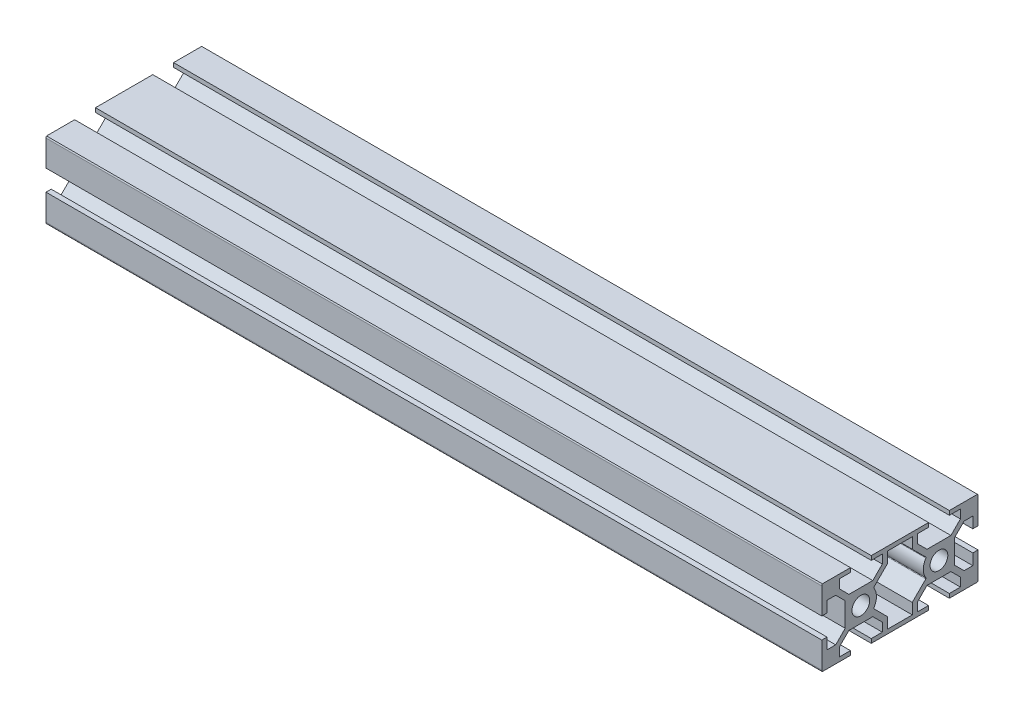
from build123d import *

# Parameters (mm, degrees)
SKETCH1_R           = 3.4
BOSS_EXTRUDE1_DEPTH = 298


with BuildPart() as part:
    # Sketch1 → Boss-Extrude1 (new body)
    with BuildSketch(Plane(origin=(0, 0, 0), x_dir=(0, 0, -1), z_dir=(1, 0, 0))):
        with BuildLine():
            Line((-30, 14), (-30, 4))
            Line((-30, 4), (-28, 4))
            Line((-28, 4), (-28, 8.25))
            Line((-28, 8.25), (-24.664213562, 8.25))
            Line((-24.664213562, 8.25), (-21, 4.585786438))
            Line((-21, 4.585786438), (-21, -4.585786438))
            Line((-21, -4.585786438), (-24.664213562, -8.25))
            Line((-24.664213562, -8.25), (-28, -8.25))
            Line((-28, -8.25), (-28, -4))
            Line((-28, -4), (-30, -4))
            Line((-30, -4), (-30, -14))
            ThreePointArc((-30, -14), (-29.948683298, -14.316227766), (-29.8, -14.6))
            Line((-29.8, -14.6), (-19, -14.6))
            Line((-19, -14.6), (-19, -13))
            Line((-19, -13), (-23.25, -13))
            Line((-23.25, -13), (-23.25, -9.664213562))
            Line((-23.25, -9.664213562), (-19.585786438, -6))
            Line((-19.585786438, -6), (-10.414213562, -6))
            Line((-10.414213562, -6), (-6.75, -9.664213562))
            Line((-6.75, -9.664213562), (-6.75, -13))
            Line((-6.75, -13), (-11, -13))
            Line((-11, -13), (-11, -14.6))
            Line((-11, -14.6), (11, -14.6))
            Line((11, -14.6), (11, -13))
            Line((11, -13), (6.75, -13))
            Line((6.75, -13), (6.75, -9.664213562))
            Line((6.75, -9.664213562), (10.414213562, -6))
            Line((10.414213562, -6), (19.585786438, -6))
            Line((19.585786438, -6), (23.25, -9.664213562))
            Line((23.25, -9.664213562), (23.25, -13))
            Line((23.25, -13), (19, -13))
            Line((19, -13), (19, -14.6))
            Line((19, -14.6), (29.8, -14.6))
            ThreePointArc((29.8, -14.6), (29.948683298, -14.316227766), (30, -14))
            Line((30, -14), (30, -4))
            Line((30, -4), (28, -4))
            Line((28, -4), (28, -8.25))
            Line((28, -8.25), (24.664213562, -8.25))
            Line((24.664213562, -8.25), (21, -4.585786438))
            Line((21, -4.585786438), (21, 4.585786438))
            Line((21, 4.585786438), (24.664213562, 8.25))
            Line((24.664213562, 8.25), (28, 8.25))
            Line((28, 8.25), (28, 4))
            Line((28, 4), (30, 4))
            Line((30, 4), (30, 14))
            ThreePointArc((30, 14), (29.948683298, 14.316227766), (29.8, 14.6))
            Line((29.8, 14.6), (19, 14.6))
            Line((19, 14.6), (19, 13))
            Line((19, 13), (23.25, 13))
            Line((23.25, 13), (23.25, 9.664213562))
            Line((23.25, 9.664213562), (19.585786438, 6))
            Line((19.585786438, 6), (10.414213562, 6))
            Line((10.414213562, 6), (6.75, 9.664213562))
            Line((6.75, 9.664213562), (6.75, 13))
            Line((6.75, 13), (11, 13))
            Line((11, 13), (11, 14.6))
            Line((11, 14.6), (-11, 14.6))
            Line((-11, 14.6), (-11, 13))
            Line((-11, 13), (-6.75, 13))
            Line((-6.75, 13), (-6.75, 9.664213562))
            Line((-6.75, 9.664213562), (-10.414213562, 6))
            Line((-10.414213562, 6), (-19.585786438, 6))
            Line((-19.585786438, 6), (-23.25, 9.664213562))
            Line((-23.25, 9.664213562), (-23.25, 13))
            Line((-23.25, 13), (-19, 13))
            Line((-19, 13), (-19, 14.6))
            Line((-19, 14.6), (-29.8, 14.6))
            ThreePointArc((-29.8, 14.6), (-29.948683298, 14.316227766), (-30, 14))
        make_face()
        with Locations((-15, 0)):
            Circle(SKETCH1_R, mode=Mode.SUBTRACT)
        with Locations((15, 0)):
            Circle(SKETCH1_R, mode=Mode.SUBTRACT)
        with BuildLine():
            Line((-4.75, 8.835786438), (-9.933994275, 3.651792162))
            ThreePointArc((-9.933994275, 3.651792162), (-10.020243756, 3.470780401), (-9.973202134, 3.275866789))
            ThreePointArc((-9.973202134, 3.275866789), (-9, 0), (-9.973202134, -3.275866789))
            ThreePointArc((-9.973202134, -3.275866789), (-10.020243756, -3.470780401), (-9.933994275, -3.651792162))
            Line((-9.933994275, -3.651792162), (-4.75, -8.835786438))
            Line((-4.75, -8.835786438), (-4.75, -13))
            Line((-4.75, -13), (4.75, -13))
            Line((4.75, -13), (4.75, -8.835786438))
            Line((4.75, -8.835786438), (9.933994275, -3.651792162))
            ThreePointArc((9.933994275, -3.651792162), (10.020243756, -3.470780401), (9.973202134, -3.275866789))
            ThreePointArc((9.973202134, -3.275866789), (9, 0), (9.973202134, 3.275866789))
            ThreePointArc((9.973202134, 3.275866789), (10.020243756, 3.470780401), (9.933994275, 3.651792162))
            Line((9.933994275, 3.651792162), (4.75, 8.835786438))
            Line((4.75, 8.835786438), (4.75, 13))
            Line((4.75, 13), (-4.75, 13))
            Line((-4.75, 13), (-4.75, 8.835786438))
        make_face(mode=Mode.SUBTRACT)
    extrude(amount=BOSS_EXTRUDE1_DEPTH)


solid = part.part
